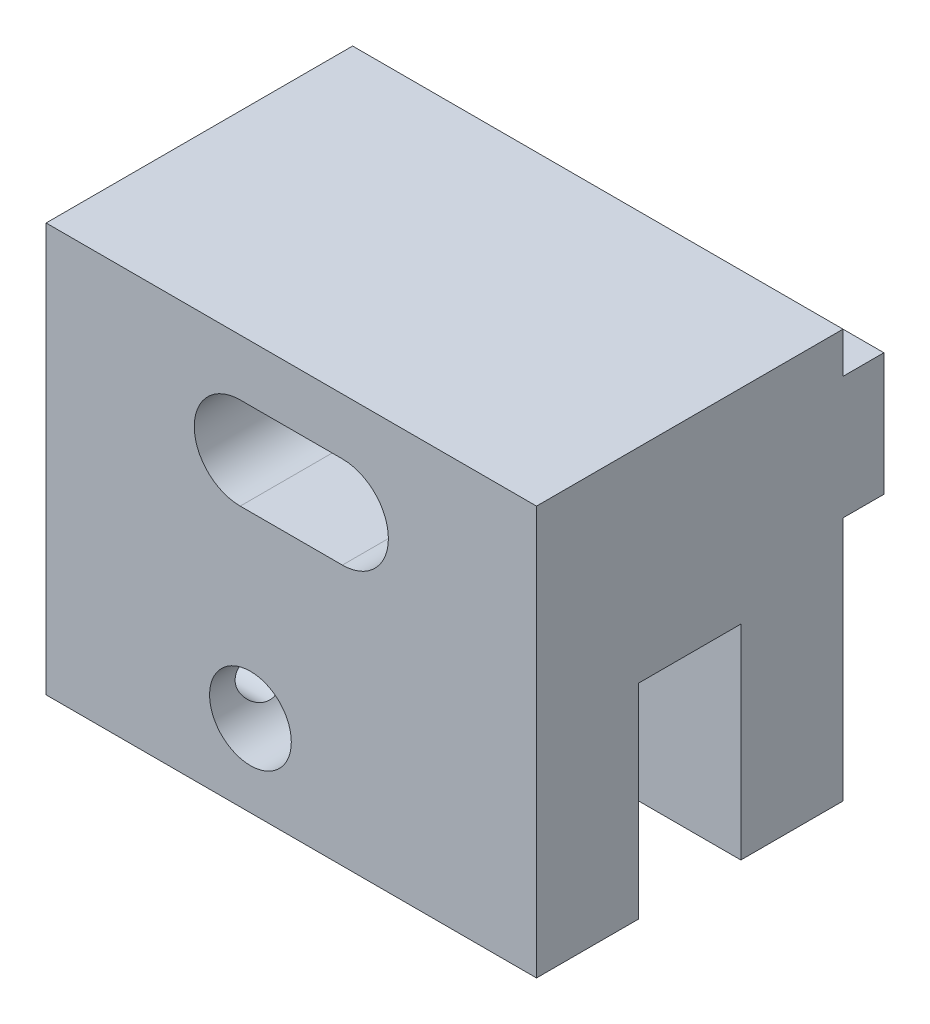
from build123d import *

# Parameters (mm, degrees)
SKETCH_1_W               = 24
SKETCH_1_H               = 20
SKETCH_1_R               = 2
EXTRUDE_1_DEPTH          = 17
SKETCH_3_OUTSIDE_W       = 26.114
SKETCH_3_OUTSIDE_H       = 29.114
CUT_EXTRUDE_1_DEPTH      = 36.566838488
CUT_EXTRUDE_2_REACH      = 37.567
CUT_EXTRUDE_2_END_RADIUS = 2
SKETCH_5_R               = 1.25
SKETCH_7_R               = 1.75
CUT_EXTRUDE_3_DEPTH      = 4


with BuildPart() as part:
    # Sketch 1 → Extrude 1 (new body)
    with BuildSketch(Plane.XY):
        with Locations((12, 10)):
            Rectangle(SKETCH_1_W, SKETCH_1_H)
        with Locations((10, 4)):
            Circle(SKETCH_1_R, mode=Mode.SUBTRACT)
        with BuildLine():
            Line((9.5, 12.75), (14.5, 12.75))
            ThreePointArc((14.5, 12.75), (16.75, 15), (14.5, 17.25))
            Line((14.5, 17.25), (9.5, 17.25))
            ThreePointArc((9.5, 17.25), (7.25, 15), (9.5, 12.75))
        make_face(mode=Mode.SUBTRACT)
    extrude(amount=EXTRUDE_1_DEPTH)

    # Sketch 3 outside → Cut-Extrude 1 (cut, through all)
    with BuildSketch(Plane(origin=(24, 0, 0), x_dir=(0, 0, -1), z_dir=(1, 0, 0))):
        with Locations((-8.5, 10)):
            Rectangle(SKETCH_3_OUTSIDE_W, SKETCH_3_OUTSIDE_H)
        Polygon((-12, 0), (-12, 10), (-7, 10), (-7, 0), (-2, 0), (-2, 12), (0, 12), (0, 18), (-2, 18), (-2, 20), (-17, 20), (-17, 0), align=None, mode=Mode.SUBTRACT)
    extrude(amount=-CUT_EXTRUDE_1_DEPTH, mode=Mode.SUBTRACT)

    # Cut-Extrude 2: up to this cylinder (the profile starts outside it)
    cut_extrude_2_end = Plane(origin=(10, 4, 9.5), z_dir=(0, 0, -1)) * Cylinder(CUT_EXTRUDE_2_END_RADIUS, 90.134, mode=Mode.PRIVATE)
    # Sketch 5 → Cut-Extrude 2 (cut, up to the surface)
    with BuildSketch(Plane.ZY, mode=Mode.PRIVATE) as cut_extrude_2_sk1:
        with Locations((4.5, 4)):
            Circle(SKETCH_5_R)
    cut_extrude_2_tool1 = extrude(cut_extrude_2_sk1.sketch, amount=-CUT_EXTRUDE_2_REACH, mode=Mode.PRIVATE) - cut_extrude_2_end
    add(cut_extrude_2_tool1.solids().sort_by_distance((0, 4, 4.5))[0], mode=Mode.SUBTRACT)
    # Sketch 5 → Cut-Extrude 2 (cut, up to the surface)
    with BuildSketch(Plane.ZY, mode=Mode.PRIVATE) as cut_extrude_2_sk2:
        with Locations((14.5, 4)):
            Circle(SKETCH_5_R)
    cut_extrude_2_tool2 = extrude(cut_extrude_2_sk2.sketch, amount=-CUT_EXTRUDE_2_REACH, mode=Mode.PRIVATE) - cut_extrude_2_end
    add(cut_extrude_2_tool2.solids().sort_by_distance((0, 4, 14.5))[0], mode=Mode.SUBTRACT)

    # Sketch 7 → Cut-Extrude 3 (cut)
    with BuildSketch(Plane.XZ.offset(-10)):
        with Locations(Location((20, 9.5, 0), (0, 0, 270))):
            Circle(SKETCH_7_R)
    extrude(amount=-CUT_EXTRUDE_3_DEPTH, mode=Mode.SUBTRACT)


solid = part.part
